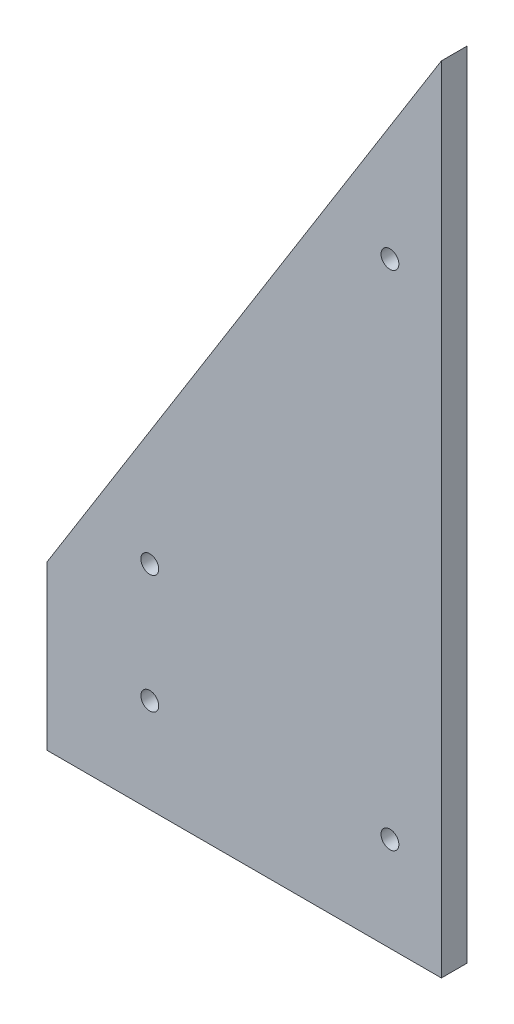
from build123d import *

# Parameters (mm, degrees)
EXTRUDE1_DEPTH = 9.525
SKETCH2_R      = 3.302
EXTRUDE2_DEPTH = 9.525


with BuildPart() as part:
    # Sketch1 → Extrude1 (new body)
    with BuildSketch(Plane.XY):
        Polygon((0, 0), (0, 60.325), (146.05, 294.053857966), (146.05, 0), align=None)
    extrude(amount=EXTRUDE1_DEPTH)

    # Sketch2 → Extrude2 (cut)
    with BuildSketch(Plane.XY.offset(9.525)):
        with Locations((38.1, 78.74)):
            Circle(SKETCH2_R)
        with Locations((127, 34.925)):
            Circle(SKETCH2_R)
        with Locations((127, 220.98)):
            Circle(SKETCH2_R)
        with Locations((38.1, 34.925)):
            Circle(SKETCH2_R)
    extrude(amount=-EXTRUDE2_DEPTH, mode=Mode.SUBTRACT)


solid = part.part
